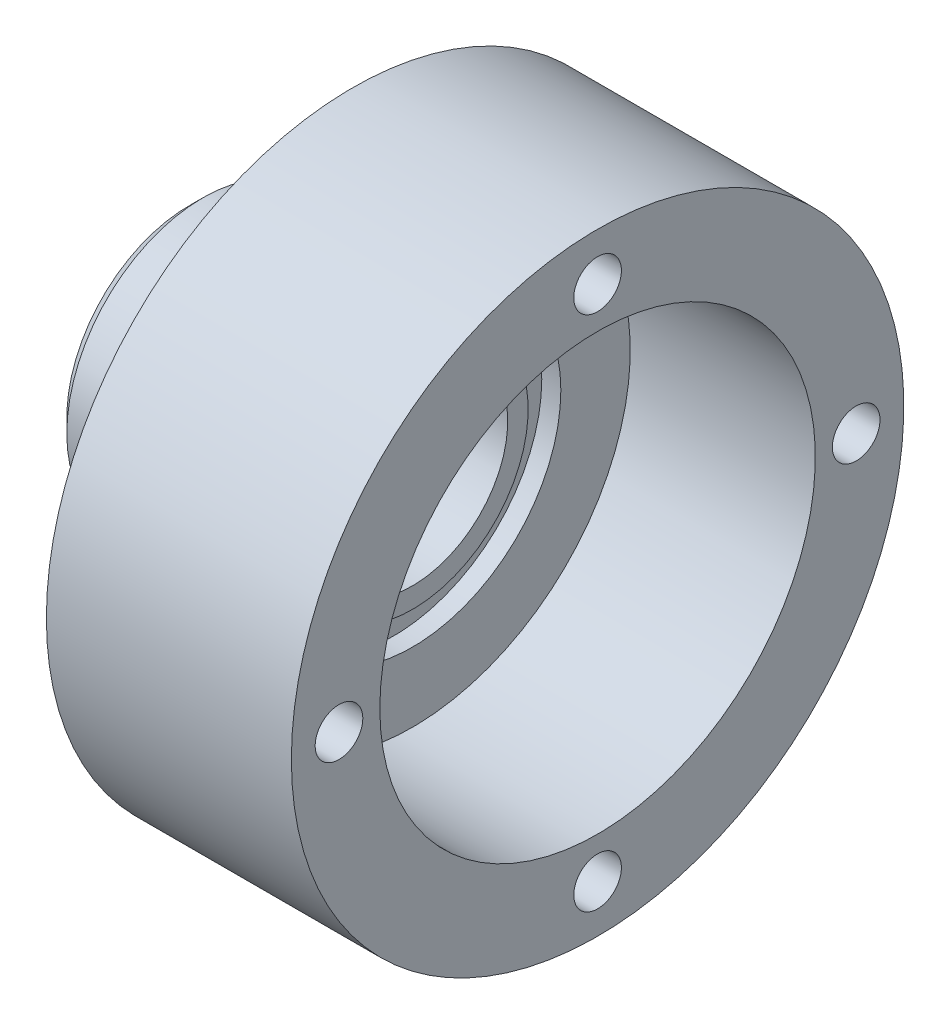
ISO-10303-21;
HEADER;
FILE_DESCRIPTION(('STEP AP214'),'2;1');
FILE_NAME('part.step','',(''),(''),'','','');
FILE_SCHEMA(('AUTOMOTIVE_DESIGN { 1 0 10303 214 1 1 1 1 }'));
ENDSEC;
DATA;
#1=APPLICATION_CONTEXT('core data for automotive mechanical design processes');
#2=APPLICATION_PROTOCOL_DEFINITION('international standard','automotive_design',2000,#1);
#3=PRODUCT_CONTEXT('',#1,'mechanical');
#4=PRODUCT('Part','Part','',(#3));
#5=PRODUCT_RELATED_PRODUCT_CATEGORY('part','',(#4));
#6=PRODUCT_DEFINITION_FORMATION('','',#4);
#7=PRODUCT_DEFINITION_CONTEXT('part definition',#1,'design');
#8=PRODUCT_DEFINITION('design','',#6,#7);
#9=PRODUCT_DEFINITION_SHAPE('','',#8);
#10=(LENGTH_UNIT() NAMED_UNIT(*) SI_UNIT(.MILLI.,.METRE.));
#11=(NAMED_UNIT(*) PLANE_ANGLE_UNIT() SI_UNIT($,.RADIAN.));
#12=(NAMED_UNIT(*) SI_UNIT($,.STERADIAN.) SOLID_ANGLE_UNIT());
#13=UNCERTAINTY_MEASURE_WITH_UNIT(LENGTH_MEASURE(1.E-05),#10,'distance_accuracy_value','');
#14=(GEOMETRIC_REPRESENTATION_CONTEXT(3) GLOBAL_UNCERTAINTY_ASSIGNED_CONTEXT((#13)) GLOBAL_UNIT_ASSIGNED_CONTEXT((#10,
#11,#12)) REPRESENTATION_CONTEXT('',''));
#15=CARTESIAN_POINT('',(0.,0.,0.));
#16=DIRECTION('',(0.,0.,1.));
#17=DIRECTION('',(1.,0.,0.));
#18=AXIS2_PLACEMENT_3D('',#15,#16,#17);
#19=CARTESIAN_POINT('',(-25.5557009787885,0.,0.));
#20=DIRECTION('',(-1.,0.,0.));
#21=DIRECTION('',(0.,0.,1.));
#22=AXIS2_PLACEMENT_3D('',#19,#20,#21);
#23=CYLINDRICAL_SURFACE('',#22,9.99999999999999);
#24=CARTESIAN_POINT('',(8.99999999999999,0.,0.));
#25=DIRECTION('',(-1.,0.,0.));
#26=DIRECTION('',(0.,0.,1.));
#27=AXIS2_PLACEMENT_3D('',#24,#25,#26);
#28=CIRCLE('',#27,9.99999999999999);
#29=CARTESIAN_POINT('',(8.99999999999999,0.,9.99999999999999));
#30=VERTEX_POINT('',#29);
#31=EDGE_CURVE('E36',#30,#30,#28,.T.);
#32=ORIENTED_EDGE('',*,*,#31,.T.);
#33=EDGE_LOOP('',(#32));
#34=FACE_BOUND('',#33,.T.);
#35=CARTESIAN_POINT('',(1.00000000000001,0.,0.));
#36=DIRECTION('',(1.,0.,0.));
#37=DIRECTION('',(0.,0.,-1.));
#38=AXIS2_PLACEMENT_3D('',#35,#36,#37);
#39=CIRCLE('',#38,9.99999999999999);
#40=CARTESIAN_POINT('',(1.00000000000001,0.,-9.99999999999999));
#41=VERTEX_POINT('',#40);
#42=EDGE_CURVE('E40',#41,#41,#39,.T.);
#43=ORIENTED_EDGE('',*,*,#42,.T.);
#44=EDGE_LOOP('',(#43));
#45=FACE_BOUND('',#44,.T.);
#46=ADVANCED_FACE('F29',(#34,#45),#23,.T.);
#47=CARTESIAN_POINT('',(-25.5557009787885,0.,0.));
#48=DIRECTION('',(-1.,0.,0.));
#49=DIRECTION('',(0.,0.,1.));
#50=AXIS2_PLACEMENT_3D('',#47,#48,#49);
#51=CYLINDRICAL_SURFACE('',#50,9.);
#52=CARTESIAN_POINT('',(10.,0.,0.));
#53=DIRECTION('',(-1.,0.,0.));
#54=DIRECTION('',(0.,0.,1.));
#55=AXIS2_PLACEMENT_3D('',#52,#53,#54);
#56=CIRCLE('',#55,9.);
#57=CARTESIAN_POINT('',(10.,0.,9.));
#58=VERTEX_POINT('',#57);
#59=EDGE_CURVE('E44',#58,#58,#56,.T.);
#60=ORIENTED_EDGE('',*,*,#59,.F.);
#61=EDGE_LOOP('',(#60));
#62=FACE_BOUND('',#61,.T.);
#63=CARTESIAN_POINT('',(12.,0.,0.));
#64=DIRECTION('',(-1.,0.,0.));
#65=DIRECTION('',(0.,0.,1.));
#66=AXIS2_PLACEMENT_3D('',#63,#64,#65);
#67=CIRCLE('',#66,9.);
#68=CARTESIAN_POINT('',(12.,0.,9.));
#69=VERTEX_POINT('',#68);
#70=EDGE_CURVE('E49',#69,#69,#67,.T.);
#71=ORIENTED_EDGE('',*,*,#70,.T.);
#72=EDGE_LOOP('',(#71));
#73=FACE_BOUND('',#72,.T.);
#74=ADVANCED_FACE('F196',(#62,#73),#51,.T.);
#75=CARTESIAN_POINT('',(12.,9.,0.));
#76=DIRECTION('',(1.,0.,0.));
#77=DIRECTION('',(0.,0.,-1.));
#78=AXIS2_PLACEMENT_3D('',#75,#76,#77);
#79=PLANE('',#78);
#80=ORIENTED_EDGE('',*,*,#70,.F.);
#81=EDGE_LOOP('',(#80));
#82=FACE_BOUND('',#81,.T.);
#83=CARTESIAN_POINT('',(12.,0.,0.));
#84=DIRECTION('',(-1.,0.,0.));
#85=DIRECTION('',(0.,0.,1.));
#86=AXIS2_PLACEMENT_3D('',#83,#84,#85);
#87=CIRCLE('',#86,11.15);
#88=CARTESIAN_POINT('',(12.,0.,11.15));
#89=VERTEX_POINT('',#88);
#90=EDGE_CURVE('E52',#89,#89,#87,.T.);
#91=ORIENTED_EDGE('',*,*,#90,.T.);
#92=EDGE_LOOP('',(#91));
#93=FACE_BOUND('',#92,.T.);
#94=ADVANCED_FACE('F201',(#82,#93),#79,.F.);
#95=CARTESIAN_POINT('',(-25.5557009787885,0.,0.));
#96=DIRECTION('',(-1.,0.,0.));
#97=DIRECTION('',(0.,0.,1.));
#98=AXIS2_PLACEMENT_3D('',#95,#96,#97);
#99=CYLINDRICAL_SURFACE('',#98,11.15);
#100=ORIENTED_EDGE('',*,*,#90,.F.);
#101=EDGE_LOOP('',(#100));
#102=FACE_BOUND('',#101,.T.);
#103=CARTESIAN_POINT('',(13.4,0.,0.));
#104=DIRECTION('',(-1.,0.,0.));
#105=DIRECTION('',(0.,0.,1.));
#106=AXIS2_PLACEMENT_3D('',#103,#104,#105);
#107=CIRCLE('',#106,11.15);
#108=CARTESIAN_POINT('',(13.4,0.,11.15));
#109=VERTEX_POINT('',#108);
#110=EDGE_CURVE('E55',#109,#109,#107,.T.);
#111=ORIENTED_EDGE('',*,*,#110,.T.);
#112=EDGE_LOOP('',(#111));
#113=FACE_BOUND('',#112,.T.);
#114=ADVANCED_FACE('F222',(#102,#113),#99,.T.);
#115=CARTESIAN_POINT('',(13.4,11.15,0.));
#116=DIRECTION('',(1.,0.,0.));
#117=DIRECTION('',(0.,0.,-1.));
#118=AXIS2_PLACEMENT_3D('',#115,#116,#117);
#119=PLANE('',#118);
#120=ORIENTED_EDGE('',*,*,#110,.F.);
#121=EDGE_LOOP('',(#120));
#122=FACE_BOUND('',#121,.T.);
#123=CARTESIAN_POINT('',(13.4,0.,0.));
#124=DIRECTION('',(-1.,0.,0.));
#125=DIRECTION('',(0.,0.,1.));
#126=AXIS2_PLACEMENT_3D('',#123,#124,#125);
#127=CIRCLE('',#126,13.95);
#128=CARTESIAN_POINT('',(13.4,0.,13.95));
#129=VERTEX_POINT('',#128);
#130=EDGE_CURVE('E58',#129,#129,#127,.T.);
#131=ORIENTED_EDGE('',*,*,#130,.T.);
#132=EDGE_LOOP('',(#131));
#133=FACE_BOUND('',#132,.T.);
#134=ADVANCED_FACE('F227',(#122,#133),#119,.F.);
#135=CARTESIAN_POINT('',(-25.5557009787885,0.,0.));
#136=DIRECTION('',(-1.,0.,0.));
#137=DIRECTION('',(0.,0.,1.));
#138=AXIS2_PLACEMENT_3D('',#135,#136,#137);
#139=CYLINDRICAL_SURFACE('',#138,13.95);
#140=ORIENTED_EDGE('',*,*,#130,.F.);
#141=EDGE_LOOP('',(#140));
#142=FACE_BOUND('',#141,.T.);
#143=CARTESIAN_POINT('',(12.,0.,0.));
#144=DIRECTION('',(-1.,0.,0.));
#145=DIRECTION('',(0.,0.,1.));
#146=AXIS2_PLACEMENT_3D('',#143,#144,#145);
#147=CIRCLE('',#146,13.95);
#148=CARTESIAN_POINT('',(12.,0.,13.95));
#149=VERTEX_POINT('',#148);
#150=EDGE_CURVE('E61',#149,#149,#147,.T.);
#151=ORIENTED_EDGE('',*,*,#150,.T.);
#152=EDGE_LOOP('',(#151));
#153=FACE_BOUND('',#152,.T.);
#154=ADVANCED_FACE('F233',(#142,#153),#139,.F.);
#155=CARTESIAN_POINT('',(12.,13.95,0.));
#156=DIRECTION('',(1.,0.,0.));
#157=DIRECTION('',(0.,0.,-1.));
#158=AXIS2_PLACEMENT_3D('',#155,#156,#157);
#159=PLANE('',#158);
#160=ORIENTED_EDGE('',*,*,#150,.F.);
#161=EDGE_LOOP('',(#160));
#162=FACE_BOUND('',#161,.T.);
#163=CARTESIAN_POINT('',(12.,0.,0.));
#164=DIRECTION('',(-1.,0.,0.));
#165=DIRECTION('',(0.,0.,1.));
#166=AXIS2_PLACEMENT_3D('',#163,#164,#165);
#167=CIRCLE('',#166,22.5);
#168=CARTESIAN_POINT('',(12.,0.,22.5));
#169=VERTEX_POINT('',#168);
#170=EDGE_CURVE('E64',#169,#169,#167,.T.);
#171=ORIENTED_EDGE('',*,*,#170,.T.);
#172=EDGE_LOOP('',(#171));
#173=FACE_BOUND('',#172,.T.);
#174=ADVANCED_FACE('F239',(#162,#173),#159,.F.);
#175=CARTESIAN_POINT('',(-25.5557009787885,0.,0.));
#176=DIRECTION('',(-1.,0.,0.));
#177=DIRECTION('',(0.,0.,1.));
#178=AXIS2_PLACEMENT_3D('',#175,#176,#177);
#179=CYLINDRICAL_SURFACE('',#178,22.5);
#180=ORIENTED_EDGE('',*,*,#170,.F.);
#181=EDGE_LOOP('',(#180));
#182=FACE_BOUND('',#181,.T.);
#183=CARTESIAN_POINT('',(30.,0.,0.));
#184=DIRECTION('',(-1.,0.,0.));
#185=DIRECTION('',(0.,0.,1.));
#186=AXIS2_PLACEMENT_3D('',#183,#184,#185);
#187=CIRCLE('',#186,22.5);
#188=CARTESIAN_POINT('',(30.,0.,22.5));
#189=VERTEX_POINT('',#188);
#190=EDGE_CURVE('E67',#189,#189,#187,.T.);
#191=ORIENTED_EDGE('',*,*,#190,.T.);
#192=EDGE_LOOP('',(#191));
#193=FACE_BOUND('',#192,.T.);
#194=ADVANCED_FACE('F132',(#182,#193),#179,.T.);
#195=CARTESIAN_POINT('',(30.,22.5,0.));
#196=DIRECTION('',(-1.,0.,0.));
#197=DIRECTION('',(0.,0.,1.));
#198=AXIS2_PLACEMENT_3D('',#195,#196,#197);
#199=PLANE('',#198);
#200=CARTESIAN_POINT('',(30.,1.99014436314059E-13,19.));
#201=DIRECTION('',(1.,0.,0.));
#202=DIRECTION('',(0.,0.,-1.));
#203=AXIS2_PLACEMENT_3D('',#200,#201,#202);
#204=CIRCLE('',#203,1.75);
#205=CARTESIAN_POINT('',(30.,1.99014436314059E-13,17.25));
#206=VERTEX_POINT('',#205);
#207=EDGE_CURVE('E113',#206,#206,#204,.T.);
#208=ORIENTED_EDGE('',*,*,#207,.F.);
#209=EDGE_LOOP('',(#208));
#210=FACE_BOUND('',#209,.T.);
#211=CARTESIAN_POINT('',(30.,-19.,1.32676290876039E-13));
#212=DIRECTION('',(1.,0.,0.));
#213=DIRECTION('',(0.,0.,-1.));
#214=AXIS2_PLACEMENT_3D('',#211,#212,#213);
#215=CIRCLE('',#214,1.75);
#216=CARTESIAN_POINT('',(30.,-19.,-1.74999999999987));
#217=VERTEX_POINT('',#216);
#218=EDGE_CURVE('E107',#217,#217,#215,.T.);
#219=ORIENTED_EDGE('',*,*,#218,.F.);
#220=EDGE_LOOP('',(#219));
#221=FACE_BOUND('',#220,.T.);
#222=CARTESIAN_POINT('',(30.,0.,-19.));
#223=DIRECTION('',(1.,0.,0.));
#224=DIRECTION('',(0.,0.,-1.));
#225=AXIS2_PLACEMENT_3D('',#222,#223,#224);
#226=CIRCLE('',#225,1.75);
#227=CARTESIAN_POINT('',(30.,0.,-20.75));
#228=VERTEX_POINT('',#227);
#229=EDGE_CURVE('E101',#228,#228,#226,.T.);
#230=ORIENTED_EDGE('',*,*,#229,.F.);
#231=EDGE_LOOP('',(#230));
#232=FACE_BOUND('',#231,.T.);
#233=CARTESIAN_POINT('',(30.,19.,0.));
#234=DIRECTION('',(1.,0.,0.));
#235=DIRECTION('',(0.,0.,-1.));
#236=AXIS2_PLACEMENT_3D('',#233,#234,#235);
#237=CIRCLE('',#236,1.75);
#238=CARTESIAN_POINT('',(30.,19.,-1.75));
#239=VERTEX_POINT('',#238);
#240=EDGE_CURVE('E95',#239,#239,#237,.T.);
#241=ORIENTED_EDGE('',*,*,#240,.F.);
#242=EDGE_LOOP('',(#241));
#243=FACE_BOUND('',#242,.T.);
#244=ORIENTED_EDGE('',*,*,#190,.F.);
#245=EDGE_LOOP('',(#244));
#246=FACE_BOUND('',#245,.T.);
#247=CARTESIAN_POINT('',(30.,0.,0.));
#248=DIRECTION('',(-1.,0.,0.));
#249=DIRECTION('',(0.,0.,1.));
#250=AXIS2_PLACEMENT_3D('',#247,#248,#249);
#251=CIRCLE('',#250,16.);
#252=CARTESIAN_POINT('',(30.,0.,16.));
#253=VERTEX_POINT('',#252);
#254=EDGE_CURVE('E70',#253,#253,#251,.T.);
#255=ORIENTED_EDGE('',*,*,#254,.T.);
#256=EDGE_LOOP('',(#255));
#257=FACE_BOUND('',#256,.T.);
#258=ADVANCED_FACE('F128',(#210,#221,#232,#243,#246,#257),#199,.F.);
#259=CARTESIAN_POINT('',(-25.5557009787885,0.,0.));
#260=DIRECTION('',(-1.,0.,0.));
#261=DIRECTION('',(0.,0.,1.));
#262=AXIS2_PLACEMENT_3D('',#259,#260,#261);
#263=CYLINDRICAL_SURFACE('',#262,16.);
#264=ORIENTED_EDGE('',*,*,#254,.F.);
#265=EDGE_LOOP('',(#264));
#266=FACE_BOUND('',#265,.T.);
#267=CARTESIAN_POINT('',(16.4,0.,0.));
#268=DIRECTION('',(-1.,0.,0.));
#269=DIRECTION('',(0.,0.,1.));
#270=AXIS2_PLACEMENT_3D('',#267,#268,#269);
#271=CIRCLE('',#270,16.);
#272=CARTESIAN_POINT('',(16.4,0.,16.));
#273=VERTEX_POINT('',#272);
#274=EDGE_CURVE('E73',#273,#273,#271,.T.);
#275=ORIENTED_EDGE('',*,*,#274,.T.);
#276=EDGE_LOOP('',(#275));
#277=FACE_BOUND('',#276,.T.);
#278=ADVANCED_FACE('F131',(#266,#277),#263,.F.);
#279=CARTESIAN_POINT('',(16.4,10.9,0.));
#280=DIRECTION('',(-1.,0.,0.));
#281=DIRECTION('',(0.,0.,1.));
#282=AXIS2_PLACEMENT_3D('',#279,#280,#281);
#283=PLANE('',#282);
#284=ORIENTED_EDGE('',*,*,#274,.F.);
#285=EDGE_LOOP('',(#284));
#286=FACE_BOUND('',#285,.T.);
#287=CARTESIAN_POINT('',(16.4,0.,0.));
#288=DIRECTION('',(-1.,0.,0.));
#289=DIRECTION('',(0.,0.,1.));
#290=AXIS2_PLACEMENT_3D('',#287,#288,#289);
#291=CIRCLE('',#290,10.9);
#292=CARTESIAN_POINT('',(16.4,0.,10.9));
#293=VERTEX_POINT('',#292);
#294=EDGE_CURVE('E76',#293,#293,#291,.T.);
#295=ORIENTED_EDGE('',*,*,#294,.T.);
#296=EDGE_LOOP('',(#295));
#297=FACE_BOUND('',#296,.T.);
#298=ADVANCED_FACE('F146',(#286,#297),#283,.F.);
#299=CARTESIAN_POINT('',(-25.5557009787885,0.,0.));
#300=DIRECTION('',(-1.,0.,0.));
#301=DIRECTION('',(0.,0.,1.));
#302=AXIS2_PLACEMENT_3D('',#299,#300,#301);
#303=CYLINDRICAL_SURFACE('',#302,10.9);
#304=ORIENTED_EDGE('',*,*,#294,.F.);
#305=EDGE_LOOP('',(#304));
#306=FACE_BOUND('',#305,.T.);
#307=CARTESIAN_POINT('',(15.,0.,0.));
#308=DIRECTION('',(-1.,0.,0.));
#309=DIRECTION('',(0.,0.,1.));
#310=AXIS2_PLACEMENT_3D('',#307,#308,#309);
#311=CIRCLE('',#310,10.9);
#312=CARTESIAN_POINT('',(15.,0.,10.9));
#313=VERTEX_POINT('',#312);
#314=EDGE_CURVE('E79',#313,#313,#311,.T.);
#315=ORIENTED_EDGE('',*,*,#314,.T.);
#316=EDGE_LOOP('',(#315));
#317=FACE_BOUND('',#316,.T.);
#318=ADVANCED_FACE('F152',(#306,#317),#303,.F.);
#319=CARTESIAN_POINT('',(15.,8.5,0.));
#320=DIRECTION('',(-1.,0.,0.));
#321=DIRECTION('',(0.,0.,1.));
#322=AXIS2_PLACEMENT_3D('',#319,#320,#321);
#323=PLANE('',#322);
#324=ORIENTED_EDGE('',*,*,#314,.F.);
#325=EDGE_LOOP('',(#324));
#326=FACE_BOUND('',#325,.T.);
#327=CARTESIAN_POINT('',(15.,0.,0.));
#328=DIRECTION('',(-1.,0.,0.));
#329=DIRECTION('',(0.,0.,1.));
#330=AXIS2_PLACEMENT_3D('',#327,#328,#329);
#331=CIRCLE('',#330,8.5);
#332=CARTESIAN_POINT('',(15.,0.,8.5));
#333=VERTEX_POINT('',#332);
#334=EDGE_CURVE('E82',#333,#333,#331,.T.);
#335=ORIENTED_EDGE('',*,*,#334,.T.);
#336=EDGE_LOOP('',(#335));
#337=FACE_BOUND('',#336,.T.);
#338=ADVANCED_FACE('F158',(#326,#337),#323,.F.);
#339=CARTESIAN_POINT('',(-25.5557009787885,0.,0.));
#340=DIRECTION('',(-1.,0.,0.));
#341=DIRECTION('',(0.,0.,1.));
#342=AXIS2_PLACEMENT_3D('',#339,#340,#341);
#343=CYLINDRICAL_SURFACE('',#342,8.5);
#344=ORIENTED_EDGE('',*,*,#334,.F.);
#345=EDGE_LOOP('',(#344));
#346=FACE_BOUND('',#345,.T.);
#347=CARTESIAN_POINT('',(16.4,0.,0.));
#348=DIRECTION('',(-1.,0.,0.));
#349=DIRECTION('',(0.,0.,1.));
#350=AXIS2_PLACEMENT_3D('',#347,#348,#349);
#351=CIRCLE('',#350,8.5);
#352=CARTESIAN_POINT('',(16.4,0.,8.5));
#353=VERTEX_POINT('',#352);
#354=EDGE_CURVE('E85',#353,#353,#351,.T.);
#355=ORIENTED_EDGE('',*,*,#354,.T.);
#356=EDGE_LOOP('',(#355));
#357=FACE_BOUND('',#356,.T.);
#358=ADVANCED_FACE('F164',(#346,#357),#343,.T.);
#359=CARTESIAN_POINT('',(16.4,7.,0.));
#360=DIRECTION('',(-1.,0.,0.));
#361=DIRECTION('',(0.,0.,1.));
#362=AXIS2_PLACEMENT_3D('',#359,#360,#361);
#363=PLANE('',#362);
#364=ORIENTED_EDGE('',*,*,#354,.F.);
#365=EDGE_LOOP('',(#364));
#366=FACE_BOUND('',#365,.T.);
#367=CARTESIAN_POINT('',(16.4,0.,0.));
#368=DIRECTION('',(-1.,0.,0.));
#369=DIRECTION('',(0.,0.,1.));
#370=AXIS2_PLACEMENT_3D('',#367,#368,#369);
#371=CIRCLE('',#370,7.);
#372=CARTESIAN_POINT('',(16.4,0.,7.));
#373=VERTEX_POINT('',#372);
#374=EDGE_CURVE('E88',#373,#373,#371,.T.);
#375=ORIENTED_EDGE('',*,*,#374,.T.);
#376=EDGE_LOOP('',(#375));
#377=FACE_BOUND('',#376,.T.);
#378=ADVANCED_FACE('F170',(#366,#377),#363,.F.);
#379=CARTESIAN_POINT('',(-25.5557009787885,0.,0.));
#380=DIRECTION('',(-1.,0.,0.));
#381=DIRECTION('',(0.,0.,1.));
#382=AXIS2_PLACEMENT_3D('',#379,#380,#381);
#383=CYLINDRICAL_SURFACE('',#382,7.);
#384=ORIENTED_EDGE('',*,*,#374,.F.);
#385=EDGE_LOOP('',(#384));
#386=FACE_BOUND('',#385,.T.);
#387=CARTESIAN_POINT('',(0.,0.,0.));
#388=DIRECTION('',(-1.,0.,0.));
#389=DIRECTION('',(0.,0.,1.));
#390=AXIS2_PLACEMENT_3D('',#387,#388,#389);
#391=CIRCLE('',#390,7.);
#392=CARTESIAN_POINT('',(0.,0.,7.));
#393=VERTEX_POINT('',#392);
#394=EDGE_CURVE('E91',#393,#393,#391,.T.);
#395=ORIENTED_EDGE('',*,*,#394,.T.);
#396=EDGE_LOOP('',(#395));
#397=FACE_BOUND('',#396,.T.);
#398=ADVANCED_FACE('F176',(#386,#397),#383,.F.);
#399=CARTESIAN_POINT('',(0.,7.,0.));
#400=DIRECTION('',(1.,0.,0.));
#401=DIRECTION('',(0.,0.,-1.));
#402=AXIS2_PLACEMENT_3D('',#399,#400,#401);
#403=PLANE('',#402);
#404=CARTESIAN_POINT('',(0.,0.,0.));
#405=DIRECTION('',(1.,0.,0.));
#406=DIRECTION('',(0.,0.,-1.));
#407=AXIS2_PLACEMENT_3D('',#404,#405,#406);
#408=CIRCLE('',#407,8.99999999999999);
#409=CARTESIAN_POINT('',(0.,0.,-8.99999999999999));
#410=VERTEX_POINT('',#409);
#411=EDGE_CURVE('E10',#410,#410,#408,.F.);
#412=ORIENTED_EDGE('',*,*,#411,.T.);
#413=EDGE_LOOP('',(#412));
#414=FACE_BOUND('',#413,.T.);
#415=ORIENTED_EDGE('',*,*,#394,.F.);
#416=EDGE_LOOP('',(#415));
#417=FACE_BOUND('',#416,.T.);
#418=ADVANCED_FACE('F182',(#414,#417),#403,.F.);
#419=CARTESIAN_POINT('',(20.,19.,0.));
#420=DIRECTION('',(1.,0.,0.));
#421=DIRECTION('',(0.,0.,-1.));
#422=AXIS2_PLACEMENT_3D('',#419,#420,#421);
#423=CYLINDRICAL_SURFACE('',#422,1.75);
#424=CARTESIAN_POINT('',(20.,19.,0.));
#425=DIRECTION('',(1.,0.,0.));
#426=DIRECTION('',(0.,0.,-1.));
#427=AXIS2_PLACEMENT_3D('',#424,#425,#426);
#428=CIRCLE('',#427,1.75);
#429=CARTESIAN_POINT('',(20.,19.,-1.75));
#430=VERTEX_POINT('',#429);
#431=EDGE_CURVE('E94',#430,#430,#428,.T.);
#432=ORIENTED_EDGE('',*,*,#431,.F.);
#433=EDGE_LOOP('',(#432));
#434=FACE_BOUND('',#433,.T.);
#435=ORIENTED_EDGE('',*,*,#240,.T.);
#436=EDGE_LOOP('',(#435));
#437=FACE_BOUND('',#436,.T.);
#438=ADVANCED_FACE('F187',(#434,#437),#423,.F.);
#439=CARTESIAN_POINT('',(20.,19.,0.));
#440=DIRECTION('',(1.,0.,0.));
#441=DIRECTION('',(0.,0.,-1.));
#442=AXIS2_PLACEMENT_3D('',#439,#440,#441);
#443=PLANE('',#442);
#444=ORIENTED_EDGE('',*,*,#431,.T.);
#445=EDGE_LOOP('',(#444));
#446=FACE_BOUND('',#445,.T.);
#447=ADVANCED_FACE('F192',(#446),#443,.T.);
#448=CARTESIAN_POINT('',(20.,0.,-19.));
#449=DIRECTION('',(1.,0.,0.));
#450=DIRECTION('',(0.,0.,-1.));
#451=AXIS2_PLACEMENT_3D('',#448,#449,#450);
#452=CYLINDRICAL_SURFACE('',#451,1.75);
#453=CARTESIAN_POINT('',(20.,0.,-19.));
#454=DIRECTION('',(1.,0.,0.));
#455=DIRECTION('',(0.,0.,-1.));
#456=AXIS2_PLACEMENT_3D('',#453,#454,#455);
#457=CIRCLE('',#456,1.75);
#458=CARTESIAN_POINT('',(20.,0.,-20.75));
#459=VERTEX_POINT('',#458);
#460=EDGE_CURVE('E98',#459,#459,#457,.T.);
#461=ORIENTED_EDGE('',*,*,#460,.F.);
#462=EDGE_LOOP('',(#461));
#463=FACE_BOUND('',#462,.T.);
#464=ORIENTED_EDGE('',*,*,#229,.T.);
#465=EDGE_LOOP('',(#464));
#466=FACE_BOUND('',#465,.T.);
#467=ADVANCED_FACE('F308',(#463,#466),#452,.F.);
#468=CARTESIAN_POINT('',(20.,0.,-19.));
#469=DIRECTION('',(1.,0.,0.));
#470=DIRECTION('',(0.,0.,-1.));
#471=AXIS2_PLACEMENT_3D('',#468,#469,#470);
#472=PLANE('',#471);
#473=ORIENTED_EDGE('',*,*,#460,.T.);
#474=EDGE_LOOP('',(#473));
#475=FACE_BOUND('',#474,.T.);
#476=ADVANCED_FACE('F317',(#475),#472,.T.);
#477=CARTESIAN_POINT('',(20.,-19.,1.32676290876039E-13));
#478=DIRECTION('',(1.,0.,0.));
#479=DIRECTION('',(0.,0.,-1.));
#480=AXIS2_PLACEMENT_3D('',#477,#478,#479);
#481=CYLINDRICAL_SURFACE('',#480,1.75);
#482=CARTESIAN_POINT('',(20.,-19.,1.32676290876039E-13));
#483=DIRECTION('',(1.,0.,0.));
#484=DIRECTION('',(0.,0.,-1.));
#485=AXIS2_PLACEMENT_3D('',#482,#483,#484);
#486=CIRCLE('',#485,1.75);
#487=CARTESIAN_POINT('',(20.,-19.,-1.74999999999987));
#488=VERTEX_POINT('',#487);
#489=EDGE_CURVE('E104',#488,#488,#486,.T.);
#490=ORIENTED_EDGE('',*,*,#489,.F.);
#491=EDGE_LOOP('',(#490));
#492=FACE_BOUND('',#491,.T.);
#493=ORIENTED_EDGE('',*,*,#218,.T.);
#494=EDGE_LOOP('',(#493));
#495=FACE_BOUND('',#494,.T.);
#496=ADVANCED_FACE('F326',(#492,#495),#481,.F.);
#497=CARTESIAN_POINT('',(20.,-19.,1.32676290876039E-13));
#498=DIRECTION('',(1.,0.,0.));
#499=DIRECTION('',(0.,0.,-1.));
#500=AXIS2_PLACEMENT_3D('',#497,#498,#499);
#501=PLANE('',#500);
#502=ORIENTED_EDGE('',*,*,#489,.T.);
#503=EDGE_LOOP('',(#502));
#504=FACE_BOUND('',#503,.T.);
#505=ADVANCED_FACE('F124',(#504),#501,.T.);
#506=CARTESIAN_POINT('',(20.,1.99014436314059E-13,19.));
#507=DIRECTION('',(1.,0.,0.));
#508=DIRECTION('',(0.,0.,-1.));
#509=AXIS2_PLACEMENT_3D('',#506,#507,#508);
#510=CYLINDRICAL_SURFACE('',#509,1.75);
#511=CARTESIAN_POINT('',(20.,1.99014436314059E-13,19.));
#512=DIRECTION('',(1.,0.,0.));
#513=DIRECTION('',(0.,0.,-1.));
#514=AXIS2_PLACEMENT_3D('',#511,#512,#513);
#515=CIRCLE('',#514,1.75);
#516=CARTESIAN_POINT('',(20.,1.99014436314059E-13,17.25));
#517=VERTEX_POINT('',#516);
#518=EDGE_CURVE('E110',#517,#517,#515,.T.);
#519=ORIENTED_EDGE('',*,*,#518,.F.);
#520=EDGE_LOOP('',(#519));
#521=FACE_BOUND('',#520,.T.);
#522=ORIENTED_EDGE('',*,*,#207,.T.);
#523=EDGE_LOOP('',(#522));
#524=FACE_BOUND('',#523,.T.);
#525=ADVANCED_FACE('F121',(#521,#524),#510,.F.);
#526=CARTESIAN_POINT('',(20.,1.99014436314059E-13,19.));
#527=DIRECTION('',(1.,0.,0.));
#528=DIRECTION('',(0.,0.,-1.));
#529=AXIS2_PLACEMENT_3D('',#526,#527,#528);
#530=PLANE('',#529);
#531=ORIENTED_EDGE('',*,*,#518,.T.);
#532=EDGE_LOOP('',(#531));
#533=FACE_BOUND('',#532,.T.);
#534=ADVANCED_FACE('F119',(#533),#530,.T.);
#535=CARTESIAN_POINT('',(8.99999999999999,0.,0.));
#536=DIRECTION('',(-1.,0.,0.));
#537=DIRECTION('',(0.,0.,1.));
#538=AXIS2_PLACEMENT_3D('',#535,#536,#537);
#539=CONICAL_SURFACE('',#538,9.99999999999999,0.785398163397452);
#540=ORIENTED_EDGE('',*,*,#59,.T.);
#541=EDGE_LOOP('',(#540));
#542=FACE_BOUND('',#541,.T.);
#543=ORIENTED_EDGE('',*,*,#31,.F.);
#544=EDGE_LOOP('',(#543));
#545=FACE_BOUND('',#544,.T.);
#546=ADVANCED_FACE('F206',(#542,#545),#539,.T.);
#547=CARTESIAN_POINT('',(0.,0.,0.));
#548=DIRECTION('',(1.,0.,0.));
#549=DIRECTION('',(0.,0.,-1.));
#550=AXIS2_PLACEMENT_3D('',#547,#548,#549);
#551=CONICAL_SURFACE('',#550,8.99999999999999,0.785398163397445);
#552=ORIENTED_EDGE('',*,*,#42,.F.);
#553=EDGE_LOOP('',(#552));
#554=FACE_BOUND('',#553,.T.);
#555=ORIENTED_EDGE('',*,*,#411,.F.);
#556=EDGE_LOOP('',(#555));
#557=FACE_BOUND('',#556,.T.);
#558=ADVANCED_FACE('F31',(#554,#557),#551,.T.);
#559=CLOSED_SHELL('',(#46,#74,#94,#114,#134,#154,#174,#194,#258,#278,#298,#318,#338,#358,#378,
#398,#418,#438,#447,#467,#476,#496,#505,#525,#534,#546,#558));
#560=MANIFOLD_SOLID_BREP('B2',#559);
#561=ADVANCED_BREP_SHAPE_REPRESENTATION('',(#18,#560),#14);
#562=SHAPE_DEFINITION_REPRESENTATION(#9,#561);
ENDSEC;
END-ISO-10303-21;
